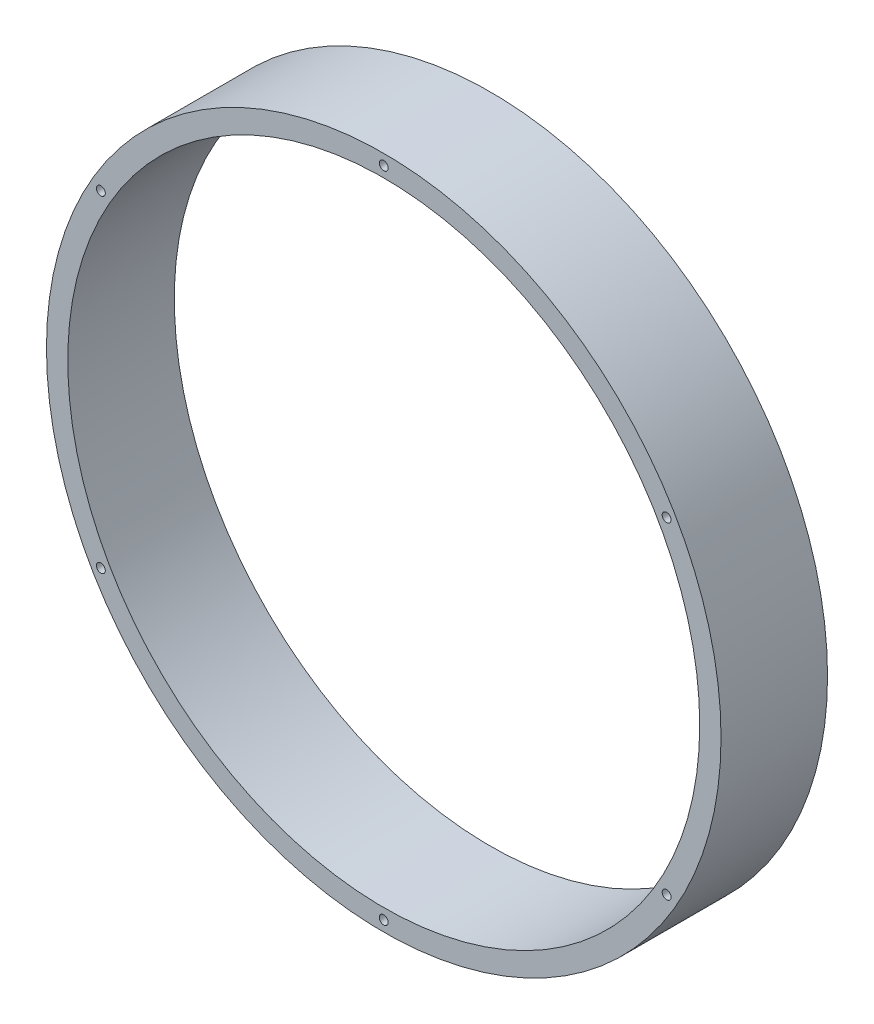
from build123d import *

# Parameters (mm, degrees)
SKETCH_1_R          = 95
SKETCH_1_R_2        = 89
EXTRUDE_1_DEPTH     = 30
SKETCH_2_R          = 1.25
CUT_EXTRUDE_1_DEPTH = 10


with BuildPart() as part:
    # Sketch 1 → Extrude 1 (new body)
    with BuildSketch(Plane.XY):
        Circle(SKETCH_1_R)
        Circle(SKETCH_1_R_2, mode=Mode.SUBTRACT)
    extrude(amount=EXTRUDE_1_DEPTH)

    # Sketch 2 → Cut-Extrude 1 (cut)
    with BuildSketch(Plane.XY.offset(30)):
        with Locations((0, 92)):
            Circle(SKETCH_2_R)
        with Locations((79.674337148, 46)):
            Circle(SKETCH_2_R)
        with Locations((79.674337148, -46)):
            Circle(SKETCH_2_R)
        with Locations((0, -92)):
            Circle(SKETCH_2_R)
        with Locations((-79.674337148, -46)):
            Circle(SKETCH_2_R)
        with Locations((-79.674337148, 46)):
            Circle(SKETCH_2_R)
    extrude(amount=-CUT_EXTRUDE_1_DEPTH, mode=Mode.SUBTRACT)


solid = part.part
